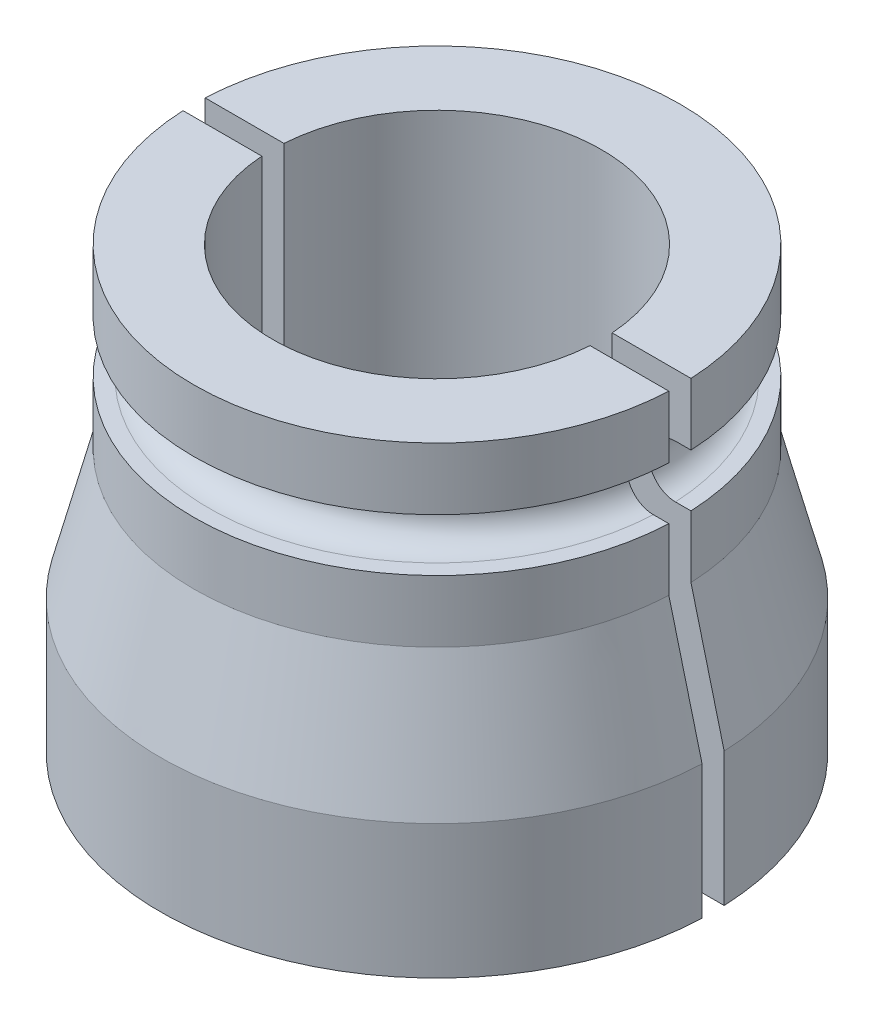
from build123d import *

# Parameters (mm, degrees)
SKETCH2_R          = 1.190625
SKETCH3_W          = 25
SKETCH3_H          = 19.9
CUT_EXTRUDE1_DEPTH = 0.5


with BuildPart() as part:
    # Sketch1 → Revolve1 (revolve)
    with BuildSketch(Plane.XY, mode=Mode.PRIVATE) as revolve1_sk:
        Polygon((11, 19.9), (7.44, 19.9), (7.44, 6.166100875), (11, 0), (12.5, 0), (12.5, 6.05), (11, 11.9), align=None)
    revolve(revolve1_sk.sketch.rotate(Axis((0, 0, 0), (0, 1, 0)), 90), axis=Axis((0, 0, 0), (0, 1, 0)))

    # Sketch2 → Cut-Revolve1 (revolve, cut)
    with BuildSketch(Plane(origin=(0, 0, 0), x_dir=(0, 0, -1), z_dir=(1, 0, 0)), mode=Mode.PRIVATE) as cut_revolve1_sk:
        with BuildLine():
            ThreePointArc((-11, 16.863113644), (-10.66802222, 17.032319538), (-10.3, 17.090625))
            Line((-10.3, 17.090625), (-11, 17.090625))
            Line((-11, 17.090625), (-11, 16.863113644))
        make_face()
        with Locations((-10.3, 15.9)):
            Circle(SKETCH2_R)
        with BuildLine():
            Line((-11, 14.709375), (-10.3, 14.709375))
            ThreePointArc((-10.3, 14.709375), (-10.66802222, 14.767680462), (-11, 14.936886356))
            Line((-11, 14.936886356), (-11, 14.709375))
        make_face()
    revolve(cut_revolve1_sk.sketch.rotate(Axis((0, 25.111962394, 0), (0, -1, 0)), 180), axis=Axis((0, 25.111962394, 0), (0, -1, 0)), mode=Mode.SUBTRACT)

    # Sketch3 → Cut-Extrude1 (cut, symmetric)
    with BuildSketch(Plane.XY):
        with Locations((0, 9.95)):
            Rectangle(SKETCH3_W, SKETCH3_H)
    extrude(amount=CUT_EXTRUDE1_DEPTH, both=True, mode=Mode.SUBTRACT)


with BuildPart() as cut_extrude1_piece_1:
    # of the separate pieces the step leaves, piece 1, a body of its own (cut_extrude1_pieces)
    add(part.part.solids().sort_by_distance((-7.423179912, 19.9, 0.5))[0])


with BuildPart() as cut_extrude1_piece_2:
    # of the separate pieces the step leaves, piece 2, a body of its own (cut_extrude1_pieces)
    add(part.part.solids().sort_by_distance((10.988630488, 19.9, -0.5))[0])


solid = Compound([cut_extrude1_piece_1.part, cut_extrude1_piece_2.part])
